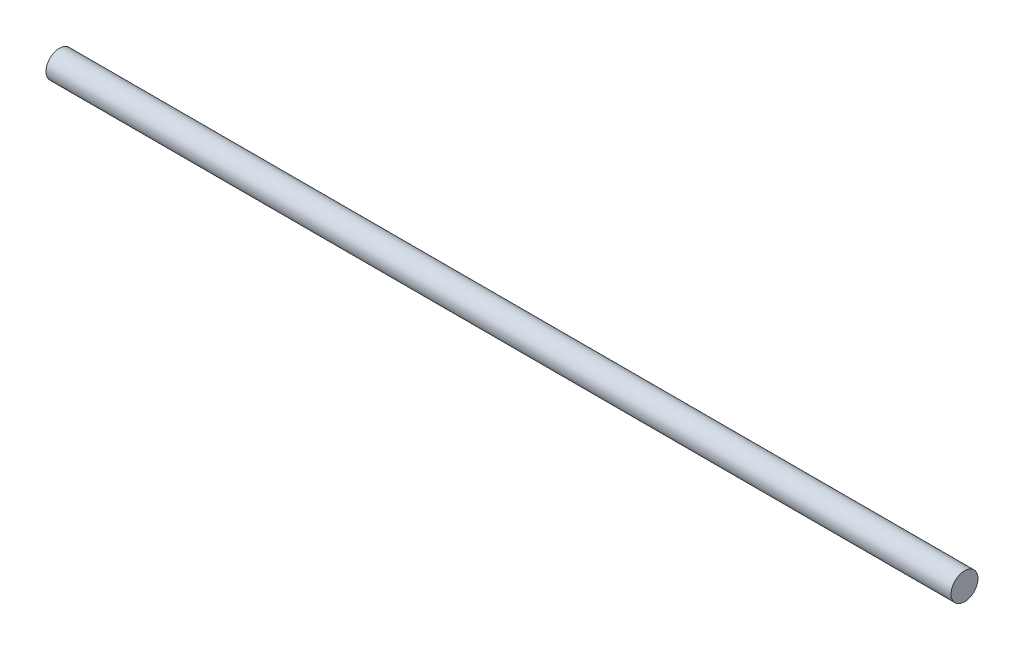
ISO-10303-21;
HEADER;
FILE_DESCRIPTION(('STEP AP214'),'2;1');
FILE_NAME('part.step','',(''),(''),'','','');
FILE_SCHEMA(('AUTOMOTIVE_DESIGN { 1 0 10303 214 1 1 1 1 }'));
ENDSEC;
DATA;
#1=APPLICATION_CONTEXT('core data for automotive mechanical design processes');
#2=APPLICATION_PROTOCOL_DEFINITION('international standard','automotive_design',2000,#1);
#3=PRODUCT_CONTEXT('',#1,'mechanical');
#4=PRODUCT('Part','Part','',(#3));
#5=PRODUCT_RELATED_PRODUCT_CATEGORY('part','',(#4));
#6=PRODUCT_DEFINITION_FORMATION('','',#4);
#7=PRODUCT_DEFINITION_CONTEXT('part definition',#1,'design');
#8=PRODUCT_DEFINITION('design','',#6,#7);
#9=PRODUCT_DEFINITION_SHAPE('','',#8);
#10=(LENGTH_UNIT() NAMED_UNIT(*) SI_UNIT(.MILLI.,.METRE.));
#11=(NAMED_UNIT(*) PLANE_ANGLE_UNIT() SI_UNIT($,.RADIAN.));
#12=(NAMED_UNIT(*) SI_UNIT($,.STERADIAN.) SOLID_ANGLE_UNIT());
#13=UNCERTAINTY_MEASURE_WITH_UNIT(LENGTH_MEASURE(1.E-05),#10,'distance_accuracy_value','');
#14=(GEOMETRIC_REPRESENTATION_CONTEXT(3) GLOBAL_UNCERTAINTY_ASSIGNED_CONTEXT((#13)) GLOBAL_UNIT_ASSIGNED_CONTEXT((#10,
#11,#12)) REPRESENTATION_CONTEXT('',''));
#15=CARTESIAN_POINT('',(0.,0.,0.));
#16=DIRECTION('',(0.,0.,1.));
#17=DIRECTION('',(1.,0.,0.));
#18=AXIS2_PLACEMENT_3D('',#15,#16,#17);
#19=CARTESIAN_POINT('',(400.,0.,0.));
#20=DIRECTION('',(-1.,0.,0.));
#21=DIRECTION('',(0.,0.,1.));
#22=AXIS2_PLACEMENT_3D('',#19,#20,#21);
#23=CYLINDRICAL_SURFACE('',#22,5.95);
#24=CARTESIAN_POINT('',(400.,0.,0.));
#25=DIRECTION('',(1.,0.,0.));
#26=DIRECTION('',(0.,0.,-1.));
#27=AXIS2_PLACEMENT_3D('',#24,#25,#26);
#28=CIRCLE('',#27,5.95);
#29=CARTESIAN_POINT('',(400.,0.,-5.95));
#30=VERTEX_POINT('',#29);
#31=EDGE_CURVE('E10',#30,#30,#28,.T.);
#32=ORIENTED_EDGE('',*,*,#31,.F.);
#33=EDGE_LOOP('',(#32));
#34=FACE_BOUND('',#33,.T.);
#35=CARTESIAN_POINT('',(0.,0.,0.));
#36=DIRECTION('',(1.,0.,0.));
#37=DIRECTION('',(0.,0.,-1.));
#38=AXIS2_PLACEMENT_3D('',#35,#36,#37);
#39=CIRCLE('',#38,5.95);
#40=CARTESIAN_POINT('',(0.,0.,-5.95));
#41=VERTEX_POINT('',#40);
#42=EDGE_CURVE('E34',#41,#41,#39,.T.);
#43=ORIENTED_EDGE('',*,*,#42,.T.);
#44=EDGE_LOOP('',(#43));
#45=FACE_BOUND('',#44,.T.);
#46=ADVANCED_FACE('F31',(#34,#45),#23,.T.);
#47=CARTESIAN_POINT('',(400.,0.,0.));
#48=DIRECTION('',(1.,0.,0.));
#49=DIRECTION('',(0.,0.,-1.));
#50=AXIS2_PLACEMENT_3D('',#47,#48,#49);
#51=PLANE('',#50);
#52=ORIENTED_EDGE('',*,*,#31,.T.);
#53=EDGE_LOOP('',(#52));
#54=FACE_BOUND('',#53,.T.);
#55=ADVANCED_FACE('F46',(#54),#51,.T.);
#56=CARTESIAN_POINT('',(0.,0.,0.));
#57=DIRECTION('',(1.,0.,0.));
#58=DIRECTION('',(0.,0.,-1.));
#59=AXIS2_PLACEMENT_3D('',#56,#57,#58);
#60=PLANE('',#59);
#61=ORIENTED_EDGE('',*,*,#42,.F.);
#62=EDGE_LOOP('',(#61));
#63=FACE_BOUND('',#62,.T.);
#64=ADVANCED_FACE('F44',(#63),#60,.F.);
#65=CLOSED_SHELL('',(#46,#55,#64));
#66=MANIFOLD_SOLID_BREP('B2',#65);
#67=ADVANCED_BREP_SHAPE_REPRESENTATION('',(#18,#66),#14);
#68=SHAPE_DEFINITION_REPRESENTATION(#9,#67);
ENDSEC;
END-ISO-10303-21;
